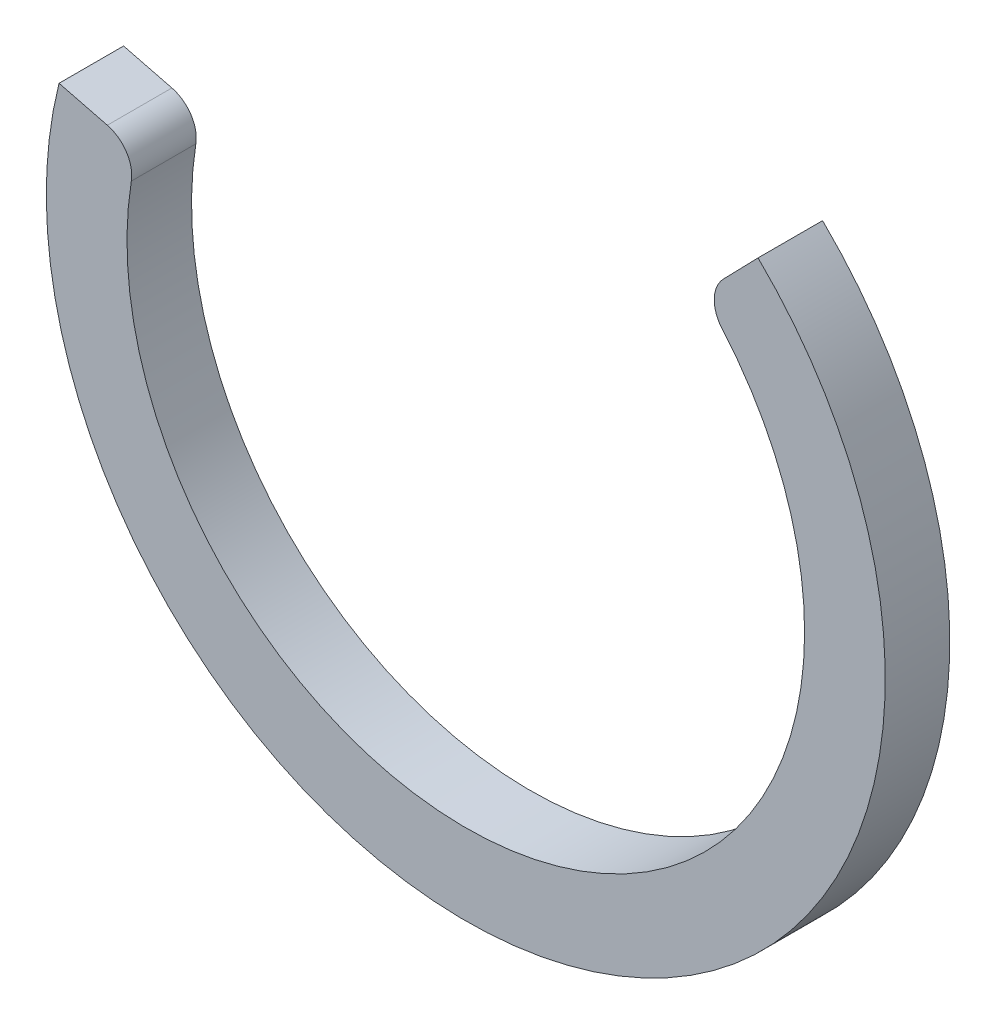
from build123d import *

# Parameters (mm, degrees)
SKETCH_1_R          = 65
EXTRUDE_1_DEPTH     = 10
SKETCH_2_R          = 52.5
CUT_EXTRUDE_1_DEPTH = 10
CUT_EXTRUDE_2_DEPTH = 10
FILLET_1_R          = 5
FILLET_2_R          = 5


with BuildPart() as part:
    # Sketch 1 → Extrude 1 (new body)
    with BuildSketch(Plane.XY):
        Circle(SKETCH_1_R)
    extrude(amount=EXTRUDE_1_DEPTH)

    # Sketch 2 → Cut-Extrude 1 (cut)
    with BuildSketch(Plane.XY.offset(10)):
        Circle(SKETCH_2_R)
    extrude(amount=-CUT_EXTRUDE_1_DEPTH, mode=Mode.SUBTRACT)

    # Sketch 3 → Cut-Extrude 2 (cut)
    with BuildSketch(Plane(origin=(0, 0, 0), x_dir=(-1, 0, 0), z_dir=(0, 0, -1))):
        with BuildLine():
            Line((-45.285806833, 46.628271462), (0, 0))
            Line((0, 0), (63.024171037, 15.904523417))
            ThreePointArc((63.024171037, 15.904523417), (17.738364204, 62.532794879), (-45.285806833, 46.628271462))
        make_face()
    extrude(amount=-CUT_EXTRUDE_2_DEPTH, mode=Mode.SUBTRACT)

    # Fillet 1
    fillet_1_edges = [part.edges().sort_by_distance(p)[0] for p in [
        (-50.904138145, 12.845961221, 5),
    ]]
    fillet(fillet_1_edges, radius=FILLET_1_R)

    # Fillet 2
    fillet_2_edges = [part.edges().sort_by_distance(p)[0] for p in [
        (36.576997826, 37.661296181, 5),
    ]]
    fillet(fillet_2_edges, radius=FILLET_2_R)


solid = part.part
